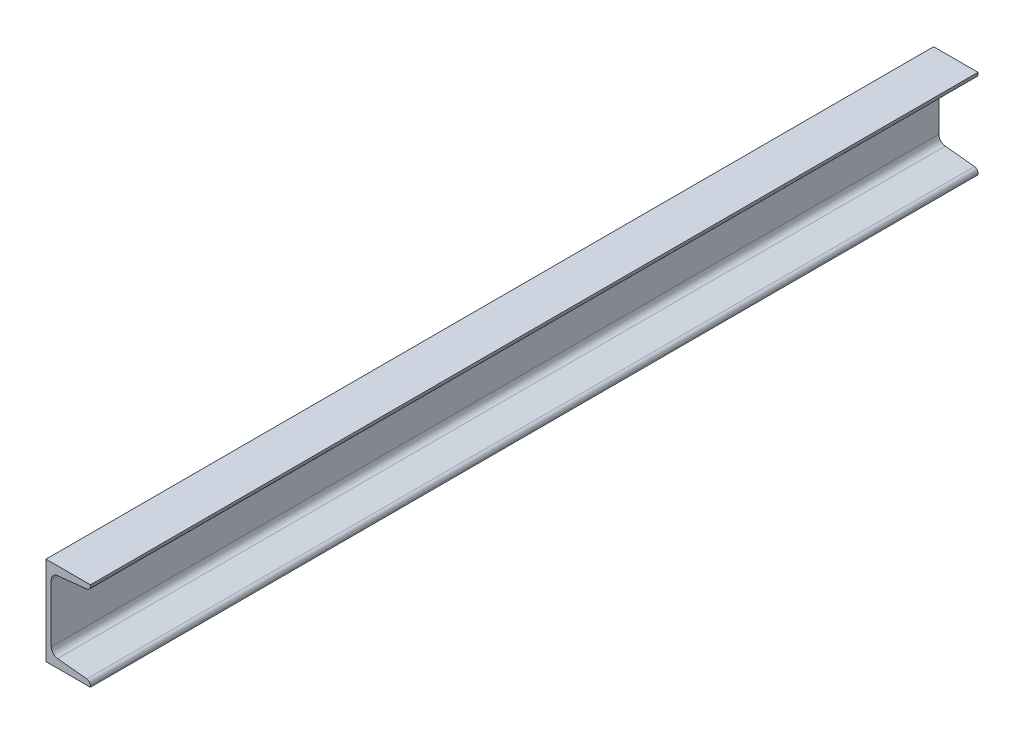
ISO-10303-21;
HEADER;
FILE_DESCRIPTION(('STEP AP214'),'2;1');
FILE_NAME('part.step','',(''),(''),'','','');
FILE_SCHEMA(('AUTOMOTIVE_DESIGN { 1 0 10303 214 1 1 1 1 }'));
ENDSEC;
DATA;
#1=APPLICATION_CONTEXT('core data for automotive mechanical design processes');
#2=APPLICATION_PROTOCOL_DEFINITION('international standard','automotive_design',2000,#1);
#3=PRODUCT_CONTEXT('',#1,'mechanical');
#4=PRODUCT('Part','Part','',(#3));
#5=PRODUCT_RELATED_PRODUCT_CATEGORY('part','',(#4));
#6=PRODUCT_DEFINITION_FORMATION('','',#4);
#7=PRODUCT_DEFINITION_CONTEXT('part definition',#1,'design');
#8=PRODUCT_DEFINITION('design','',#6,#7);
#9=PRODUCT_DEFINITION_SHAPE('','',#8);
#10=(LENGTH_UNIT() NAMED_UNIT(*) SI_UNIT(.MILLI.,.METRE.));
#11=(NAMED_UNIT(*) PLANE_ANGLE_UNIT() SI_UNIT($,.RADIAN.));
#12=(NAMED_UNIT(*) SI_UNIT($,.STERADIAN.) SOLID_ANGLE_UNIT());
#13=UNCERTAINTY_MEASURE_WITH_UNIT(LENGTH_MEASURE(1.E-05),#10,'distance_accuracy_value','');
#14=(GEOMETRIC_REPRESENTATION_CONTEXT(3) GLOBAL_UNCERTAINTY_ASSIGNED_CONTEXT((#13)) GLOBAL_UNIT_ASSIGNED_CONTEXT((#10,
#11,#12)) REPRESENTATION_CONTEXT('',''));
#15=CARTESIAN_POINT('',(0.,0.,0.));
#16=DIRECTION('',(0.,0.,1.));
#17=DIRECTION('',(1.,0.,0.));
#18=AXIS2_PLACEMENT_3D('',#15,#16,#17);
#19=CARTESIAN_POINT('',(0.,0.,1000.));
#20=DIRECTION('',(0.,1.,0.));
#21=DIRECTION('',(0.,0.,1.));
#22=AXIS2_PLACEMENT_3D('',#19,#20,#21);
#23=PLANE('',#22);
#24=DIRECTION('',(1.,0.,0.));
#25=VECTOR('',#24,1.);
#26=CARTESIAN_POINT('',(0.,0.,0.));
#27=LINE('',#26,#25);
#28=CARTESIAN_POINT('',(0.,0.,0.));
#29=VERTEX_POINT('',#28);
#30=CARTESIAN_POINT('',(50.,0.,0.));
#31=VERTEX_POINT('',#30);
#32=EDGE_CURVE('E150',#29,#31,#27,.T.);
#33=ORIENTED_EDGE('',*,*,#32,.T.);
#34=DIRECTION('',(0.,0.,-1.));
#35=VECTOR('',#34,1.);
#36=CARTESIAN_POINT('',(50.,0.,1000.));
#37=LINE('',#36,#35);
#38=CARTESIAN_POINT('',(50.,0.,1000.));
#39=VERTEX_POINT('',#38);
#40=EDGE_CURVE('E11',#39,#31,#37,.T.);
#41=ORIENTED_EDGE('',*,*,#40,.F.);
#42=DIRECTION('',(1.,0.,0.));
#43=VECTOR('',#42,1.);
#44=CARTESIAN_POINT('',(0.,0.,1000.));
#45=LINE('',#44,#43);
#46=CARTESIAN_POINT('',(0.,0.,1000.));
#47=VERTEX_POINT('',#46);
#48=EDGE_CURVE('E172',#47,#39,#45,.T.);
#49=ORIENTED_EDGE('',*,*,#48,.F.);
#50=DIRECTION('',(0.,0.,-1.));
#51=VECTOR('',#50,1.);
#52=CARTESIAN_POINT('',(0.,0.,1000.));
#53=LINE('',#52,#51);
#54=EDGE_CURVE('E146',#47,#29,#53,.T.);
#55=ORIENTED_EDGE('',*,*,#54,.T.);
#56=EDGE_LOOP('',(#33,#41,#49,#55));
#57=FACE_BOUND('',#56,.T.);
#58=ADVANCED_FACE('F30',(#57),#23,.F.);
#59=CARTESIAN_POINT('',(50.,0.,1000.));
#60=DIRECTION('',(-1.,0.,0.));
#61=DIRECTION('',(0.,0.,1.));
#62=AXIS2_PLACEMENT_3D('',#59,#60,#61);
#63=PLANE('',#62);
#64=DIRECTION('',(0.,1.,0.));
#65=VECTOR('',#64,1.);
#66=CARTESIAN_POINT('',(50.,0.,0.));
#67=LINE('',#66,#65);
#68=CARTESIAN_POINT('',(50.,1.63063341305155,0.));
#69=VERTEX_POINT('',#68);
#70=EDGE_CURVE('E153',#31,#69,#67,.T.);
#71=ORIENTED_EDGE('',*,*,#70,.T.);
#72=DIRECTION('',(0.,0.,-1.));
#73=VECTOR('',#72,1.);
#74=CARTESIAN_POINT('',(50.,1.63063341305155,1000.));
#75=LINE('',#74,#73);
#76=CARTESIAN_POINT('',(50.,1.63063341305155,1000.));
#77=VERTEX_POINT('',#76);
#78=EDGE_CURVE('E38',#77,#69,#75,.T.);
#79=ORIENTED_EDGE('',*,*,#78,.F.);
#80=DIRECTION('',(0.,1.,0.));
#81=VECTOR('',#80,1.);
#82=CARTESIAN_POINT('',(50.,0.,1000.));
#83=LINE('',#82,#81);
#84=EDGE_CURVE('E101',#39,#77,#83,.T.);
#85=ORIENTED_EDGE('',*,*,#84,.F.);
#86=ORIENTED_EDGE('',*,*,#40,.T.);
#87=EDGE_LOOP('',(#71,#79,#85,#86));
#88=FACE_BOUND('',#87,.T.);
#89=ADVANCED_FACE('F250',(#88),#63,.F.);
#90=CARTESIAN_POINT('',(45.5,1.63063341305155,1000.));
#91=DIRECTION('',(0.,0.,-1.));
#92=DIRECTION('',(-1.,0.,0.));
#93=AXIS2_PLACEMENT_3D('',#90,#91,#92);
#94=CYLINDRICAL_SURFACE('',#93,4.5);
#95=CARTESIAN_POINT('',(45.5,1.63063341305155,0.));
#96=DIRECTION('',(0.,0.,1.));
#97=DIRECTION('',(1.,0.,0.));
#98=AXIS2_PLACEMENT_3D('',#95,#96,#97);
#99=CIRCLE('',#98,4.5);
#100=CARTESIAN_POINT('',(45.9703780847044,6.10598194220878,0.));
#101=VERTEX_POINT('',#100);
#102=EDGE_CURVE('E155',#69,#101,#99,.T.);
#103=ORIENTED_EDGE('',*,*,#102,.T.);
#104=DIRECTION('',(0.,0.,-1.));
#105=VECTOR('',#104,1.);
#106=CARTESIAN_POINT('',(45.9703780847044,6.10598194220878,1000.));
#107=LINE('',#106,#105);
#108=CARTESIAN_POINT('',(45.9703780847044,6.10598194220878,1000.));
#109=VERTEX_POINT('',#108);
#110=EDGE_CURVE('E191',#109,#101,#107,.T.);
#111=ORIENTED_EDGE('',*,*,#110,.F.);
#112=CARTESIAN_POINT('',(45.5,1.63063341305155,1000.));
#113=DIRECTION('',(0.,0.,1.));
#114=DIRECTION('',(1.,0.,0.));
#115=AXIS2_PLACEMENT_3D('',#112,#113,#114);
#116=CIRCLE('',#115,4.5);
#117=EDGE_CURVE('E199',#77,#109,#116,.T.);
#118=ORIENTED_EDGE('',*,*,#117,.F.);
#119=ORIENTED_EDGE('',*,*,#78,.T.);
#120=EDGE_LOOP('',(#103,#111,#118,#119));
#121=FACE_BOUND('',#120,.T.);
#122=ADVANCED_FACE('F197',(#121),#94,.T.);
#123=CARTESIAN_POINT('',(13.0637722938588,9.56460557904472,1000.));
#124=DIRECTION('',(-0.104528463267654,-0.994521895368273,0.));
#125=DIRECTION('',(0.994521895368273,-0.104528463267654,0.));
#126=AXIS2_PLACEMENT_3D('',#123,#124,#125);
#127=PLANE('',#126);
#128=DIRECTION('',(-0.994521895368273,0.104528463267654,0.));
#129=VECTOR('',#128,1.);
#130=CARTESIAN_POINT('',(13.0637722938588,9.56460557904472,0.));
#131=LINE('',#130,#129);
#132=CARTESIAN_POINT('',(13.0637722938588,9.56460557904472,0.));
#133=VERTEX_POINT('',#132);
#134=EDGE_CURVE('E157',#101,#133,#131,.T.);
#135=ORIENTED_EDGE('',*,*,#134,.T.);
#136=DIRECTION('',(0.,0.,-1.));
#137=VECTOR('',#136,1.);
#138=CARTESIAN_POINT('',(13.0637722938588,9.56460557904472,1000.));
#139=LINE('',#138,#137);
#140=CARTESIAN_POINT('',(13.0637722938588,9.56460557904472,1000.));
#141=VERTEX_POINT('',#140);
#142=EDGE_CURVE('E188',#141,#133,#139,.T.);
#143=ORIENTED_EDGE('',*,*,#142,.F.);
#144=DIRECTION('',(-0.994521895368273,0.104528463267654,0.));
#145=VECTOR('',#144,1.);
#146=CARTESIAN_POINT('',(13.0637722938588,9.56460557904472,1000.));
#147=LINE('',#146,#145);
#148=EDGE_CURVE('E217',#109,#141,#147,.T.);
#149=ORIENTED_EDGE('',*,*,#148,.F.);
#150=ORIENTED_EDGE('',*,*,#110,.T.);
#151=EDGE_LOOP('',(#135,#143,#149,#150));
#152=FACE_BOUND('',#151,.T.);
#153=ADVANCED_FACE('F208',(#152),#127,.F.);
#154=CARTESIAN_POINT('',(13.9,17.5207807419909,1000.));
#155=DIRECTION('',(0.,0.,-1.));
#156=DIRECTION('',(-1.,0.,0.));
#157=AXIS2_PLACEMENT_3D('',#154,#155,#156);
#158=CYLINDRICAL_SURFACE('',#157,8.);
#159=CARTESIAN_POINT('',(13.9,17.5207807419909,0.));
#160=DIRECTION('',(0.,0.,-1.));
#161=DIRECTION('',(1.,0.,0.));
#162=AXIS2_PLACEMENT_3D('',#159,#160,#161);
#163=CIRCLE('',#162,8.);
#164=CARTESIAN_POINT('',(5.9,17.5207807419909,0.));
#165=VERTEX_POINT('',#164);
#166=EDGE_CURVE('E159',#133,#165,#163,.T.);
#167=ORIENTED_EDGE('',*,*,#166,.T.);
#168=DIRECTION('',(0.,0.,-1.));
#169=VECTOR('',#168,1.);
#170=CARTESIAN_POINT('',(5.9,17.5207807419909,1000.));
#171=LINE('',#170,#169);
#172=CARTESIAN_POINT('',(5.9,17.5207807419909,1000.));
#173=VERTEX_POINT('',#172);
#174=EDGE_CURVE('E185',#173,#165,#171,.T.);
#175=ORIENTED_EDGE('',*,*,#174,.F.);
#176=CARTESIAN_POINT('',(13.9,17.5207807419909,1000.));
#177=DIRECTION('',(0.,0.,-1.));
#178=DIRECTION('',(1.,0.,0.));
#179=AXIS2_PLACEMENT_3D('',#176,#177,#178);
#180=CIRCLE('',#179,8.);
#181=EDGE_CURVE('E214',#141,#173,#180,.T.);
#182=ORIENTED_EDGE('',*,*,#181,.F.);
#183=ORIENTED_EDGE('',*,*,#142,.T.);
#184=EDGE_LOOP('',(#167,#175,#182,#183));
#185=FACE_BOUND('',#184,.T.);
#186=ADVANCED_FACE('F212',(#185),#158,.F.);
#187=CARTESIAN_POINT('',(5.89999999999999,82.4792192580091,1000.));
#188=DIRECTION('',(-1.,0.,0.));
#189=DIRECTION('',(0.,-1.,0.));
#190=AXIS2_PLACEMENT_3D('',#187,#188,#189);
#191=PLANE('',#190);
#192=DIRECTION('',(0.,1.,0.));
#193=VECTOR('',#192,1.);
#194=CARTESIAN_POINT('',(5.89999999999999,82.4792192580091,0.));
#195=LINE('',#194,#193);
#196=CARTESIAN_POINT('',(5.89999999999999,82.4792192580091,0.));
#197=VERTEX_POINT('',#196);
#198=EDGE_CURVE('E161',#165,#197,#195,.T.);
#199=ORIENTED_EDGE('',*,*,#198,.T.);
#200=DIRECTION('',(0.,0.,-1.));
#201=VECTOR('',#200,1.);
#202=CARTESIAN_POINT('',(5.89999999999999,82.4792192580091,1000.));
#203=LINE('',#202,#201);
#204=CARTESIAN_POINT('',(5.89999999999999,82.4792192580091,1000.));
#205=VERTEX_POINT('',#204);
#206=EDGE_CURVE('E182',#205,#197,#203,.T.);
#207=ORIENTED_EDGE('',*,*,#206,.F.);
#208=DIRECTION('',(0.,1.,0.));
#209=VECTOR('',#208,1.);
#210=CARTESIAN_POINT('',(5.89999999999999,82.4792192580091,1000.));
#211=LINE('',#210,#209);
#212=EDGE_CURVE('E216',#173,#205,#211,.T.);
#213=ORIENTED_EDGE('',*,*,#212,.F.);
#214=ORIENTED_EDGE('',*,*,#174,.T.);
#215=EDGE_LOOP('',(#199,#207,#213,#214));
#216=FACE_BOUND('',#215,.T.);
#217=ADVANCED_FACE('F263',(#216),#191,.F.);
#218=CARTESIAN_POINT('',(13.9,82.4792192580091,1000.));
#219=DIRECTION('',(0.,0.,-1.));
#220=DIRECTION('',(-1.,0.,0.));
#221=AXIS2_PLACEMENT_3D('',#218,#219,#220);
#222=CYLINDRICAL_SURFACE('',#221,8.);
#223=CARTESIAN_POINT('',(13.9,82.4792192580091,0.));
#224=DIRECTION('',(0.,0.,-1.));
#225=DIRECTION('',(-1.,0.,0.));
#226=AXIS2_PLACEMENT_3D('',#223,#224,#225);
#227=CIRCLE('',#226,8.);
#228=CARTESIAN_POINT('',(13.0637722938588,90.4353944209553,0.));
#229=VERTEX_POINT('',#228);
#230=EDGE_CURVE('E163',#197,#229,#227,.T.);
#231=ORIENTED_EDGE('',*,*,#230,.T.);
#232=DIRECTION('',(0.,0.,-1.));
#233=VECTOR('',#232,1.);
#234=CARTESIAN_POINT('',(13.0637722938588,90.4353944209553,1000.));
#235=LINE('',#234,#233);
#236=CARTESIAN_POINT('',(13.0637722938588,90.4353944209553,1000.));
#237=VERTEX_POINT('',#236);
#238=EDGE_CURVE('E179',#237,#229,#235,.T.);
#239=ORIENTED_EDGE('',*,*,#238,.F.);
#240=CARTESIAN_POINT('',(13.9,82.4792192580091,1000.));
#241=DIRECTION('',(0.,0.,-1.));
#242=DIRECTION('',(-1.,0.,0.));
#243=AXIS2_PLACEMENT_3D('',#240,#241,#242);
#244=CIRCLE('',#243,8.);
#245=EDGE_CURVE('E219',#205,#237,#244,.T.);
#246=ORIENTED_EDGE('',*,*,#245,.F.);
#247=ORIENTED_EDGE('',*,*,#206,.T.);
#248=EDGE_LOOP('',(#231,#239,#246,#247));
#249=FACE_BOUND('',#248,.T.);
#250=ADVANCED_FACE('F266',(#249),#222,.F.);
#251=CARTESIAN_POINT('',(13.0637722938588,90.4353944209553,1000.));
#252=DIRECTION('',(-0.104528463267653,0.994521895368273,0.));
#253=DIRECTION('',(-0.994521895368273,-0.104528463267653,0.));
#254=AXIS2_PLACEMENT_3D('',#251,#252,#253);
#255=PLANE('',#254);
#256=DIRECTION('',(0.994521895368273,0.104528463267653,0.));
#257=VECTOR('',#256,1.);
#258=CARTESIAN_POINT('',(13.0637722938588,90.4353944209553,0.));
#259=LINE('',#258,#257);
#260=CARTESIAN_POINT('',(45.9703780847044,93.8940180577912,0.));
#261=VERTEX_POINT('',#260);
#262=EDGE_CURVE('E165',#229,#261,#259,.T.);
#263=ORIENTED_EDGE('',*,*,#262,.T.);
#264=DIRECTION('',(0.,0.,-1.));
#265=VECTOR('',#264,1.);
#266=CARTESIAN_POINT('',(45.9703780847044,93.8940180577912,1000.));
#267=LINE('',#266,#265);
#268=CARTESIAN_POINT('',(45.9703780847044,93.8940180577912,1000.));
#269=VERTEX_POINT('',#268);
#270=EDGE_CURVE('E176',#269,#261,#267,.T.);
#271=ORIENTED_EDGE('',*,*,#270,.F.);
#272=DIRECTION('',(0.994521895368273,0.104528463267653,0.));
#273=VECTOR('',#272,1.);
#274=CARTESIAN_POINT('',(13.0637722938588,90.4353944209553,1000.));
#275=LINE('',#274,#273);
#276=EDGE_CURVE('E225',#237,#269,#275,.T.);
#277=ORIENTED_EDGE('',*,*,#276,.F.);
#278=ORIENTED_EDGE('',*,*,#238,.T.);
#279=EDGE_LOOP('',(#263,#271,#277,#278));
#280=FACE_BOUND('',#279,.T.);
#281=ADVANCED_FACE('F231',(#280),#255,.F.);
#282=CARTESIAN_POINT('',(45.5,98.3693665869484,1000.));
#283=DIRECTION('',(0.,0.,-1.));
#284=DIRECTION('',(-1.,0.,0.));
#285=AXIS2_PLACEMENT_3D('',#282,#283,#284);
#286=CYLINDRICAL_SURFACE('',#285,4.5);
#287=CARTESIAN_POINT('',(45.5,98.3693665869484,0.));
#288=DIRECTION('',(0.,0.,1.));
#289=DIRECTION('',(-1.,0.,0.));
#290=AXIS2_PLACEMENT_3D('',#287,#288,#289);
#291=CIRCLE('',#290,4.5);
#292=CARTESIAN_POINT('',(50.,98.3693665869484,0.));
#293=VERTEX_POINT('',#292);
#294=EDGE_CURVE('E167',#261,#293,#291,.T.);
#295=ORIENTED_EDGE('',*,*,#294,.T.);
#296=DIRECTION('',(0.,0.,-1.));
#297=VECTOR('',#296,1.);
#298=CARTESIAN_POINT('',(50.,98.3693665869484,1000.));
#299=LINE('',#298,#297);
#300=CARTESIAN_POINT('',(50.,98.3693665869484,1000.));
#301=VERTEX_POINT('',#300);
#302=EDGE_CURVE('E141',#301,#293,#299,.T.);
#303=ORIENTED_EDGE('',*,*,#302,.F.);
#304=CARTESIAN_POINT('',(45.5,98.3693665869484,1000.));
#305=DIRECTION('',(0.,0.,1.));
#306=DIRECTION('',(-1.,0.,0.));
#307=AXIS2_PLACEMENT_3D('',#304,#305,#306);
#308=CIRCLE('',#307,4.5);
#309=EDGE_CURVE('E132',#269,#301,#308,.T.);
#310=ORIENTED_EDGE('',*,*,#309,.F.);
#311=ORIENTED_EDGE('',*,*,#270,.T.);
#312=EDGE_LOOP('',(#295,#303,#310,#311));
#313=FACE_BOUND('',#312,.T.);
#314=ADVANCED_FACE('F235',(#313),#286,.T.);
#315=CARTESIAN_POINT('',(50.,100.,1000.));
#316=DIRECTION('',(-1.,0.,0.));
#317=DIRECTION('',(0.,-1.,0.));
#318=AXIS2_PLACEMENT_3D('',#315,#316,#317);
#319=PLANE('',#318);
#320=DIRECTION('',(0.,1.,0.));
#321=VECTOR('',#320,1.);
#322=CARTESIAN_POINT('',(50.,100.,0.));
#323=LINE('',#322,#321);
#324=CARTESIAN_POINT('',(50.,100.,0.));
#325=VERTEX_POINT('',#324);
#326=EDGE_CURVE('E140',#293,#325,#323,.T.);
#327=ORIENTED_EDGE('',*,*,#326,.T.);
#328=DIRECTION('',(0.,0.,-1.));
#329=VECTOR('',#328,1.);
#330=CARTESIAN_POINT('',(50.,100.,1000.));
#331=LINE('',#330,#329);
#332=CARTESIAN_POINT('',(50.,100.,1000.));
#333=VERTEX_POINT('',#332);
#334=EDGE_CURVE('E137',#333,#325,#331,.T.);
#335=ORIENTED_EDGE('',*,*,#334,.F.);
#336=DIRECTION('',(0.,1.,0.));
#337=VECTOR('',#336,1.);
#338=CARTESIAN_POINT('',(50.,100.,1000.));
#339=LINE('',#338,#337);
#340=EDGE_CURVE('E126',#301,#333,#339,.T.);
#341=ORIENTED_EDGE('',*,*,#340,.F.);
#342=ORIENTED_EDGE('',*,*,#302,.T.);
#343=EDGE_LOOP('',(#327,#335,#341,#342));
#344=FACE_BOUND('',#343,.T.);
#345=ADVANCED_FACE('F138',(#344),#319,.F.);
#346=CARTESIAN_POINT('',(0.,100.,1000.));
#347=DIRECTION('',(0.,-1.,0.));
#348=DIRECTION('',(0.,0.,-1.));
#349=AXIS2_PLACEMENT_3D('',#346,#347,#348);
#350=PLANE('',#349);
#351=DIRECTION('',(-1.,0.,0.));
#352=VECTOR('',#351,1.);
#353=CARTESIAN_POINT('',(0.,100.,0.));
#354=LINE('',#353,#352);
#355=CARTESIAN_POINT('',(0.,100.,0.));
#356=VERTEX_POINT('',#355);
#357=EDGE_CURVE('E87',#325,#356,#354,.T.);
#358=ORIENTED_EDGE('',*,*,#357,.T.);
#359=DIRECTION('',(0.,0.,-1.));
#360=VECTOR('',#359,1.);
#361=CARTESIAN_POINT('',(0.,100.,1000.));
#362=LINE('',#361,#360);
#363=CARTESIAN_POINT('',(0.,100.,1000.));
#364=VERTEX_POINT('',#363);
#365=EDGE_CURVE('E142',#364,#356,#362,.T.);
#366=ORIENTED_EDGE('',*,*,#365,.F.);
#367=DIRECTION('',(-1.,0.,0.));
#368=VECTOR('',#367,1.);
#369=CARTESIAN_POINT('',(0.,100.,1000.));
#370=LINE('',#369,#368);
#371=EDGE_CURVE('E130',#333,#364,#370,.T.);
#372=ORIENTED_EDGE('',*,*,#371,.F.);
#373=ORIENTED_EDGE('',*,*,#334,.T.);
#374=EDGE_LOOP('',(#358,#366,#372,#373));
#375=FACE_BOUND('',#374,.T.);
#376=ADVANCED_FACE('F144',(#375),#350,.F.);
#377=CARTESIAN_POINT('',(0.,0.,1000.));
#378=DIRECTION('',(1.,0.,0.));
#379=DIRECTION('',(0.,1.,0.));
#380=AXIS2_PLACEMENT_3D('',#377,#378,#379);
#381=PLANE('',#380);
#382=DIRECTION('',(0.,-1.,0.));
#383=VECTOR('',#382,1.);
#384=CARTESIAN_POINT('',(0.,0.,0.));
#385=LINE('',#384,#383);
#386=EDGE_CURVE('E93',#356,#29,#385,.T.);
#387=ORIENTED_EDGE('',*,*,#386,.T.);
#388=ORIENTED_EDGE('',*,*,#54,.F.);
#389=DIRECTION('',(0.,-1.,0.));
#390=VECTOR('',#389,1.);
#391=CARTESIAN_POINT('',(0.,0.,1000.));
#392=LINE('',#391,#390);
#393=EDGE_CURVE('E46',#364,#47,#392,.T.);
#394=ORIENTED_EDGE('',*,*,#393,.F.);
#395=ORIENTED_EDGE('',*,*,#365,.T.);
#396=EDGE_LOOP('',(#387,#388,#394,#395));
#397=FACE_BOUND('',#396,.T.);
#398=ADVANCED_FACE('F239',(#397),#381,.F.);
#399=CARTESIAN_POINT('',(45.5,1.63063341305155,1000.));
#400=DIRECTION('',(0.,0.,1.));
#401=DIRECTION('',(1.,0.,0.));
#402=AXIS2_PLACEMENT_3D('',#399,#400,#401);
#403=PLANE('',#402);
#404=ORIENTED_EDGE('',*,*,#48,.T.);
#405=ORIENTED_EDGE('',*,*,#84,.T.);
#406=ORIENTED_EDGE('',*,*,#117,.T.);
#407=ORIENTED_EDGE('',*,*,#148,.T.);
#408=ORIENTED_EDGE('',*,*,#181,.T.);
#409=ORIENTED_EDGE('',*,*,#212,.T.);
#410=ORIENTED_EDGE('',*,*,#245,.T.);
#411=ORIENTED_EDGE('',*,*,#276,.T.);
#412=ORIENTED_EDGE('',*,*,#309,.T.);
#413=ORIENTED_EDGE('',*,*,#340,.T.);
#414=ORIENTED_EDGE('',*,*,#371,.T.);
#415=ORIENTED_EDGE('',*,*,#393,.T.);
#416=EDGE_LOOP('',(#404,#405,#406,#407,#408,#409,#410,#411,#412,#413,#414,#415));
#417=FACE_BOUND('',#416,.T.);
#418=ADVANCED_FACE('F128',(#417),#403,.T.);
#419=CARTESIAN_POINT('',(45.5,1.63063341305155,0.));
#420=DIRECTION('',(0.,0.,1.));
#421=DIRECTION('',(1.,0.,0.));
#422=AXIS2_PLACEMENT_3D('',#419,#420,#421);
#423=PLANE('',#422);
#424=ORIENTED_EDGE('',*,*,#32,.F.);
#425=ORIENTED_EDGE('',*,*,#386,.F.);
#426=ORIENTED_EDGE('',*,*,#357,.F.);
#427=ORIENTED_EDGE('',*,*,#326,.F.);
#428=ORIENTED_EDGE('',*,*,#294,.F.);
#429=ORIENTED_EDGE('',*,*,#262,.F.);
#430=ORIENTED_EDGE('',*,*,#230,.F.);
#431=ORIENTED_EDGE('',*,*,#198,.F.);
#432=ORIENTED_EDGE('',*,*,#166,.F.);
#433=ORIENTED_EDGE('',*,*,#134,.F.);
#434=ORIENTED_EDGE('',*,*,#102,.F.);
#435=ORIENTED_EDGE('',*,*,#70,.F.);
#436=EDGE_LOOP('',(#424,#425,#426,#427,#428,#429,#430,#431,#432,#433,#434,#435));
#437=FACE_BOUND('',#436,.T.);
#438=ADVANCED_FACE('F203',(#437),#423,.F.);
#439=CLOSED_SHELL('',(#58,#89,#122,#153,#186,#217,#250,#281,#314,#345,#376,#398,#418,#438));
#440=MANIFOLD_SOLID_BREP('B2',#439);
#441=ADVANCED_BREP_SHAPE_REPRESENTATION('',(#18,#440),#14);
#442=SHAPE_DEFINITION_REPRESENTATION(#9,#441);
ENDSEC;
END-ISO-10303-21;
